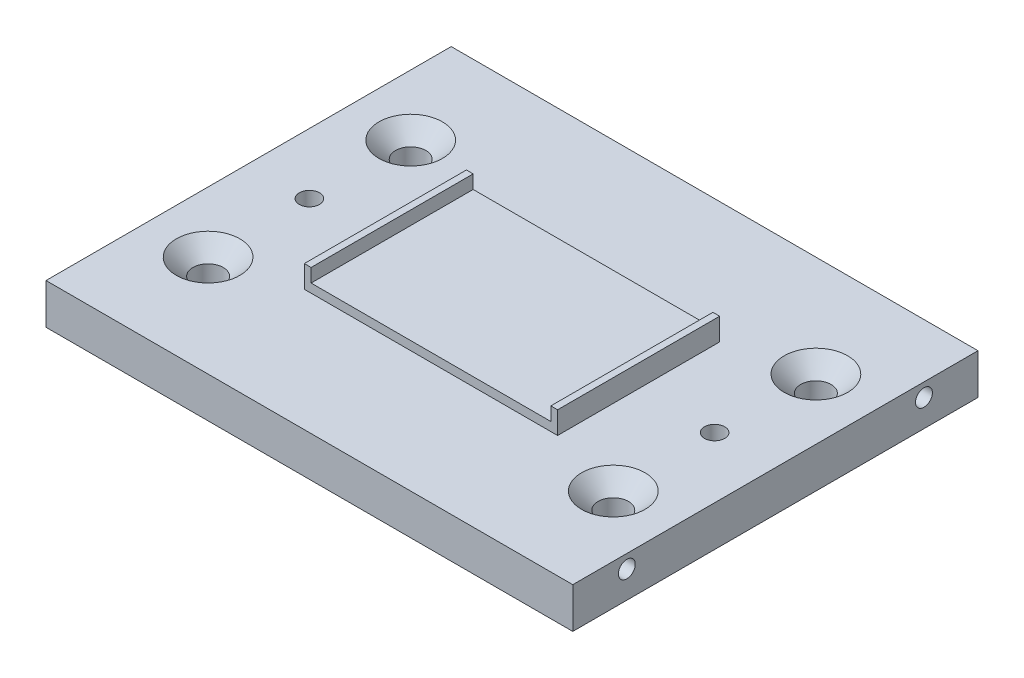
from build123d import *

# Parameters (mm, degrees)
SKETCH1_W                                       = 60
SKETCH1_H                                       = 6
BOSS_EXTRUDE1_DEPTH                             = 39
SKETCH2_W                                       = 37.5
SKETCH2_H                                       = 24
BOSS_EXTRUDE2_DEPTH                             = 1.3
SKETCH5_W                                       = 1
SKETCH5_H                                       = 24
BOSS_EXTRUDE3_DEPTH                             = 2
CSK_FOR_M4_FLAT_HEAD_MACHINE_SCREW1_D           = 4.5
CSK_FOR_M4_FLAT_HEAD_MACHINE_SCREW1_CSINK_D     = 9.4
CSK_FOR_M4_FLAT_HEAD_MACHINE_SCREW1_CSINK_ANGLE = 90
F_3_0_3_DIAMETER_HOLE2_D                        = 3
M3X0_5_TAPPED_HOLE1_AT_2_COUNT                  = 2
M3X0_5_TAPPED_HOLE1_AT_2_PITCH                  = 44


with BuildPart() as part:
    # Sketch1 → Boss-Extrude1 (new, symmetric)
    with BuildSketch(Plane(origin=(0, 0, 0), x_dir=(0, 0, -1), z_dir=(1, 0, 0))):
        Rectangle(SKETCH1_W, SKETCH1_H)
    extrude(amount=BOSS_EXTRUDE1_DEPTH, both=True)

    # Sketch2 → Boss-Extrude2 (add)
    with BuildSketch(Plane(origin=(0, 3, 0), x_dir=(1, 0, 0), z_dir=(0, 1, 0))):
        Rectangle(SKETCH2_W, SKETCH2_H)
    extrude(amount=BOSS_EXTRUDE2_DEPTH)

    # Sketch5 → Boss-Extrude3 (add)
    with BuildSketch(Plane(origin=(0, 4.3, 0), x_dir=(1, 0, 0), z_dir=(0, 1, 0))):
        with Locations((-18.25, 0)):
            Rectangle(SKETCH5_W, SKETCH5_H)
        with Locations((18.25, 0)):
            Rectangle(SKETCH5_W, SKETCH5_H)
    extrude(amount=BOSS_EXTRUDE3_DEPTH)

    # CSK for M4 Flat Head Machine Screw1 (through all)
    with Locations(Plane(origin=(0, 3, 0), x_dir=(1, 0, 0), z_dir=(0, 1, 0))):
        with Locations((-30, 15), (30, 15), (30, -15), (-30, -15)):
            CounterSinkHole(CSK_FOR_M4_FLAT_HEAD_MACHINE_SCREW1_D / 2, CSK_FOR_M4_FLAT_HEAD_MACHINE_SCREW1_CSINK_D / 2, counter_sink_angle=CSK_FOR_M4_FLAT_HEAD_MACHINE_SCREW1_CSINK_ANGLE)

    # 3.0 _3_ Diameter Hole2 (through all)
    with Locations(Plane(origin=(0, 3, 0), x_dir=(1, 0, 0), z_dir=(0, 1, 0))):
        with Locations((-30, 0), (30, 0)):
            Hole(F_3_0_3_DIAMETER_HOLE2_D / 2)

    # Sketch10 → M3x0.5 Tapped Hole1 (revolve, cut)
    with BuildSketch(Plane(origin=(-39, 1, -22), x_dir=(0, 0, 1), z_dir=(0, 1, 0))):
        Polygon((0, 0), (0, 8.251075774), (1.25, 7.5), (1.25, 0), align=None)
    m3x0_5_tapped_hole1 = revolve(axis=Axis((-45.35, 1, -22), (1, 0, 0)), mode=Mode.SUBTRACT)

    # M3x0.5 Tapped Hole1 at 2: M3x0.5 Tapped Hole1 ×2
    with Locations(*[(0, 0, i * M3X0_5_TAPPED_HOLE1_AT_2_PITCH) for i in range(1, M3X0_5_TAPPED_HOLE1_AT_2_COUNT)]):
        add(m3x0_5_tapped_hole1, mode=Mode.SUBTRACT)

    # Mirror1: M3x0.5 Tapped Hole1 across plane
    add(m3x0_5_tapped_hole1.mirror(Plane(origin=(0, 0, 0), x_dir=(0, 0, 1), z_dir=(1, 0, 0))), mode=Mode.SUBTRACT)

    # Mirror1 copy 1 sketch → Mirror1 copy 1 (revolve, cut)
    with BuildSketch(Plane(origin=(39, 1, 22), x_dir=(0, 0, 1), z_dir=(0, 1, 0))):
        Polygon((0, 0), (0, -8.251075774), (1.25, -7.5), (1.25, 0), align=None)
    revolve(axis=Axis((45.35, 1, 22), (1, 0, 0)), mode=Mode.SUBTRACT)


solid = part.part
